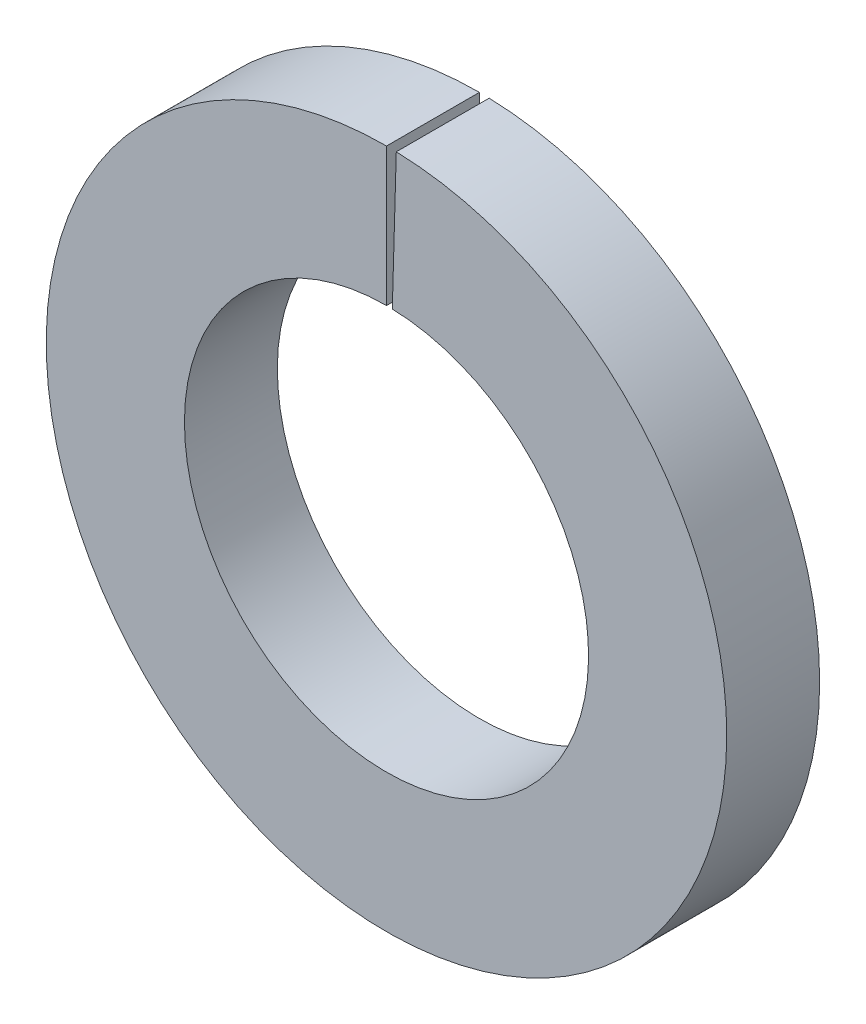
from build123d import *

# Parameters (mm, degrees)
SKETCH1_R          = 3.7211
SKETCH1_R_2        = 2.2098
WASHER_DEPTH       = 1.016
CUT_EXTRUDE1_DEPTH = 6.359610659


with BuildPart() as part:
    # Sketch1 → Washer (new body)
    with BuildSketch(Plane.XY):
        Circle(SKETCH1_R)
        Circle(SKETCH1_R_2, mode=Mode.SUBTRACT)
    extrude(amount=WASHER_DEPTH)

    # Sketch2 → Cut-Extrude1 (cut, through all)
    with BuildSketch(Plane(origin=(0, 0, 0), x_dir=(-1, 0, 0), z_dir=(0, 0, -1))):
        with BuildLine():
            Line((0, 2.2098), (0, 3.7211))
            ThreePointArc((0, 3.7211), (-0.05346408, 3.720715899), (-0.106917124, 3.719563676))
            Line((-0.106917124, 3.719563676), (-0.063493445, 2.208887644))
            ThreePointArc((-0.063493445, 2.208887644), (-0.03175, 2.209571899), (0, 2.2098))
        make_face()
    extrude(amount=-CUT_EXTRUDE1_DEPTH, mode=Mode.SUBTRACT)


solid = part.part
